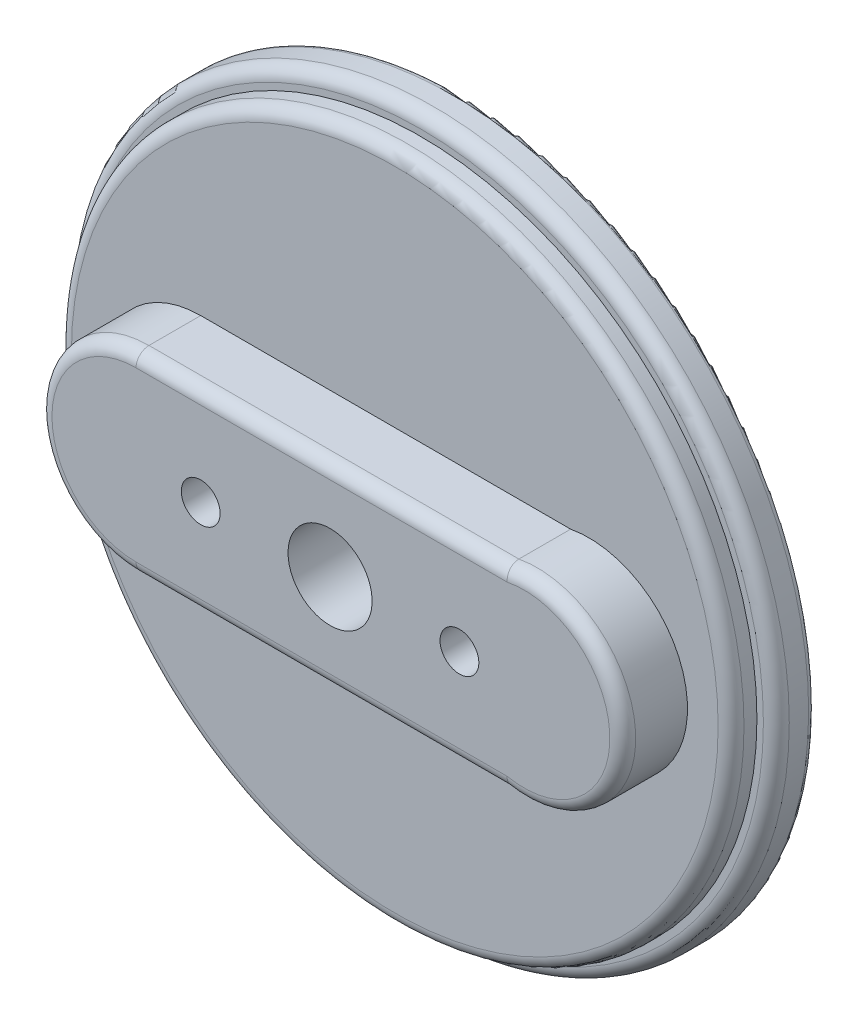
ISO-10303-21;
HEADER;
FILE_DESCRIPTION(('STEP AP214'),'2;1');
FILE_NAME('part.step','',(''),(''),'','','');
FILE_SCHEMA(('AUTOMOTIVE_DESIGN { 1 0 10303 214 1 1 1 1 }'));
ENDSEC;
DATA;
#1=APPLICATION_CONTEXT('core data for automotive mechanical design processes');
#2=APPLICATION_PROTOCOL_DEFINITION('international standard','automotive_design',2000,#1);
#3=PRODUCT_CONTEXT('',#1,'mechanical');
#4=PRODUCT('Part','Part','',(#3));
#5=PRODUCT_RELATED_PRODUCT_CATEGORY('part','',(#4));
#6=PRODUCT_DEFINITION_FORMATION('','',#4);
#7=PRODUCT_DEFINITION_CONTEXT('part definition',#1,'design');
#8=PRODUCT_DEFINITION('design','',#6,#7);
#9=PRODUCT_DEFINITION_SHAPE('','',#8);
#10=(LENGTH_UNIT() NAMED_UNIT(*) SI_UNIT(.MILLI.,.METRE.));
#11=(NAMED_UNIT(*) PLANE_ANGLE_UNIT() SI_UNIT($,.RADIAN.));
#12=(NAMED_UNIT(*) SI_UNIT($,.STERADIAN.) SOLID_ANGLE_UNIT());
#13=UNCERTAINTY_MEASURE_WITH_UNIT(LENGTH_MEASURE(1.E-05),#10,'distance_accuracy_value','');
#14=(GEOMETRIC_REPRESENTATION_CONTEXT(3) GLOBAL_UNCERTAINTY_ASSIGNED_CONTEXT((#13)) GLOBAL_UNIT_ASSIGNED_CONTEXT((#10,
#11,#12)) REPRESENTATION_CONTEXT('',''));
#15=CARTESIAN_POINT('',(0.,0.,0.));
#16=DIRECTION('',(0.,0.,1.));
#17=DIRECTION('',(1.,0.,0.));
#18=AXIS2_PLACEMENT_3D('',#15,#16,#17);
#19=CARTESIAN_POINT('',(0.,-60.6414213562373,5.));
#20=DIRECTION('',(0.,0.,1.));
#21=DIRECTION('',(1.,0.,0.));
#22=AXIS2_PLACEMENT_3D('',#19,#20,#21);
#23=PLANE('',#22);
#24=CARTESIAN_POINT('',(0.,0.,5.));
#25=DIRECTION('',(0.,0.,1.));
#26=DIRECTION('',(1.,0.,0.));
#27=AXIS2_PLACEMENT_3D('',#24,#25,#26);
#28=CIRCLE('',#27,25.);
#29=CARTESIAN_POINT('',(25.,0.,5.));
#30=VERTEX_POINT('',#29);
#31=EDGE_CURVE('E261',#30,#30,#28,.T.);
#32=ORIENTED_EDGE('',*,*,#31,.T.);
#33=EDGE_LOOP('',(#32));
#34=FACE_BOUND('',#33,.T.);
#35=CARTESIAN_POINT('',(15.,0.,5.));
#36=DIRECTION('',(0.,0.,1.));
#37=DIRECTION('',(1.,0.,0.));
#38=AXIS2_PLACEMENT_3D('',#35,#36,#37);
#39=CIRCLE('',#38,7.6299405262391);
#40=CARTESIAN_POINT('',(13.5978614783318,-7.5,5.));
#41=VERTEX_POINT('',#40);
#42=CARTESIAN_POINT('',(13.5978614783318,7.5,5.));
#43=VERTEX_POINT('',#42);
#44=EDGE_CURVE('E253',#41,#43,#39,.T.);
#45=ORIENTED_EDGE('',*,*,#44,.F.);
#46=DIRECTION('',(-1.,0.,0.));
#47=VECTOR('',#46,1.);
#48=CARTESIAN_POINT('',(0.,-7.5,5.));
#49=LINE('',#48,#47);
#50=CARTESIAN_POINT('',(-15.,-7.5,5.));
#51=VERTEX_POINT('',#50);
#52=EDGE_CURVE('E158',#41,#51,#49,.T.);
#53=ORIENTED_EDGE('',*,*,#52,.T.);
#54=CARTESIAN_POINT('',(-15.,0.,5.));
#55=DIRECTION('',(0.,0.,1.));
#56=DIRECTION('',(1.,0.,0.));
#57=AXIS2_PLACEMENT_3D('',#54,#55,#56);
#58=CIRCLE('',#57,7.5);
#59=CARTESIAN_POINT('',(-15.,7.5,5.));
#60=VERTEX_POINT('',#59);
#61=EDGE_CURVE('E251',#60,#51,#58,.T.);
#62=ORIENTED_EDGE('',*,*,#61,.F.);
#63=DIRECTION('',(-1.,0.,0.));
#64=VECTOR('',#63,1.);
#65=CARTESIAN_POINT('',(0.,7.5,5.));
#66=LINE('',#65,#64);
#67=EDGE_CURVE('E298',#43,#60,#66,.T.);
#68=ORIENTED_EDGE('',*,*,#67,.F.);
#69=EDGE_LOOP('',(#45,#53,#62,#68));
#70=FACE_BOUND('',#69,.T.);
#71=ADVANCED_FACE('F34',(#34,#70),#23,.T.);
#72=CARTESIAN_POINT('',(0.,0.,10.));
#73=DIRECTION('',(0.,0.,1.));
#74=DIRECTION('',(1.,0.,0.));
#75=AXIS2_PLACEMENT_3D('',#72,#73,#74);
#76=PLANE('',#75);
#77=CARTESIAN_POINT('',(10.,0.,10.));
#78=DIRECTION('',(0.,0.,1.));
#79=DIRECTION('',(1.,0.,0.));
#80=AXIS2_PLACEMENT_3D('',#77,#78,#79);
#81=CIRCLE('',#80,1.5);
#82=CARTESIAN_POINT('',(11.5,0.,10.));
#83=VERTEX_POINT('',#82);
#84=EDGE_CURVE('E417',#83,#83,#81,.T.);
#85=ORIENTED_EDGE('',*,*,#84,.F.);
#86=EDGE_LOOP('',(#85));
#87=FACE_BOUND('',#86,.T.);
#88=CARTESIAN_POINT('',(-10.,0.,10.));
#89=DIRECTION('',(0.,0.,1.));
#90=DIRECTION('',(1.,0.,0.));
#91=AXIS2_PLACEMENT_3D('',#88,#89,#90);
#92=CIRCLE('',#91,1.5);
#93=CARTESIAN_POINT('',(-8.5,0.,10.));
#94=VERTEX_POINT('',#93);
#95=EDGE_CURVE('E426',#94,#94,#92,.T.);
#96=ORIENTED_EDGE('',*,*,#95,.F.);
#97=EDGE_LOOP('',(#96));
#98=FACE_BOUND('',#97,.T.);
#99=DIRECTION('',(-1.,0.,0.));
#100=VECTOR('',#99,1.);
#101=CARTESIAN_POINT('',(13.5978614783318,-6.5,10.));
#102=LINE('',#101,#100);
#103=CARTESIAN_POINT('',(-15.,-6.5,10.));
#104=VERTEX_POINT('',#103);
#105=CARTESIAN_POINT('',(13.6938180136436,-6.5,10.));
#106=VERTEX_POINT('',#105);
#107=EDGE_CURVE('E272',#104,#106,#102,.F.);
#108=ORIENTED_EDGE('',*,*,#107,.T.);
#109=CARTESIAN_POINT('',(15.,0.,10.));
#110=DIRECTION('',(0.,0.,1.));
#111=DIRECTION('',(1.,0.,0.));
#112=AXIS2_PLACEMENT_3D('',#109,#110,#111);
#113=CIRCLE('',#112,6.6299405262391);
#114=CARTESIAN_POINT('',(13.6938180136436,6.5,10.));
#115=VERTEX_POINT('',#114);
#116=EDGE_CURVE('E274',#106,#115,#113,.T.);
#117=ORIENTED_EDGE('',*,*,#116,.T.);
#118=DIRECTION('',(-1.,0.,0.));
#119=VECTOR('',#118,1.);
#120=CARTESIAN_POINT('',(0.,6.5,10.));
#121=LINE('',#120,#119);
#122=CARTESIAN_POINT('',(-15.,6.5,10.));
#123=VERTEX_POINT('',#122);
#124=EDGE_CURVE('E268',#115,#123,#121,.T.);
#125=ORIENTED_EDGE('',*,*,#124,.T.);
#126=CARTESIAN_POINT('',(-15.,0.,10.));
#127=DIRECTION('',(0.,0.,1.));
#128=DIRECTION('',(1.,0.,0.));
#129=AXIS2_PLACEMENT_3D('',#126,#127,#128);
#130=CIRCLE('',#129,6.5);
#131=EDGE_CURVE('E270',#123,#104,#130,.T.);
#132=ORIENTED_EDGE('',*,*,#131,.T.);
#133=EDGE_LOOP('',(#108,#117,#125,#132));
#134=FACE_BOUND('',#133,.T.);
#135=CARTESIAN_POINT('',(0.,0.,10.));
#136=DIRECTION('',(0.,0.,-1.));
#137=DIRECTION('',(-1.,0.,0.));
#138=AXIS2_PLACEMENT_3D('',#135,#136,#137);
#139=CIRCLE('',#138,3.25);
#140=CARTESIAN_POINT('',(-3.25,0.,10.));
#141=VERTEX_POINT('',#140);
#142=EDGE_CURVE('E146',#141,#141,#139,.T.);
#143=ORIENTED_EDGE('',*,*,#142,.T.);
#144=EDGE_LOOP('',(#143));
#145=FACE_BOUND('',#144,.T.);
#146=ADVANCED_FACE('F204',(#87,#98,#134,#145),#76,.T.);
#147=CARTESIAN_POINT('',(0.,0.,3.));
#148=DIRECTION('',(0.,0.,-1.));
#149=DIRECTION('',(-1.,0.,0.));
#150=AXIS2_PLACEMENT_3D('',#147,#148,#149);
#151=PLANE('',#150);
#152=CARTESIAN_POINT('',(-15.,0.,3.));
#153=DIRECTION('',(0.,0.,-1.));
#154=DIRECTION('',(-1.,0.,0.));
#155=AXIS2_PLACEMENT_3D('',#152,#153,#154);
#156=CIRCLE('',#155,9.62787722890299);
#157=CARTESIAN_POINT('',(-13.4360243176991,9.5,3.));
#158=VERTEX_POINT('',#157);
#159=CARTESIAN_POINT('',(-13.0898573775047,-9.43649167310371,3.));
#160=VERTEX_POINT('',#159);
#161=EDGE_CURVE('E131',#158,#160,#156,.F.);
#162=ORIENTED_EDGE('',*,*,#161,.T.);
#163=DIRECTION('',(1.,0.,0.));
#164=VECTOR('',#163,1.);
#165=CARTESIAN_POINT('',(13.5332564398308,-9.43649167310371,3.));
#166=LINE('',#165,#164);
#167=CARTESIAN_POINT('',(-12.7919286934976,-9.43649167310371,3.));
#168=VERTEX_POINT('',#167);
#169=EDGE_CURVE('E123',#160,#168,#166,.T.);
#170=ORIENTED_EDGE('',*,*,#169,.T.);
#171=DIRECTION('',(1.,0.,0.));
#172=VECTOR('',#171,1.);
#173=CARTESIAN_POINT('',(13.5332564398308,-9.43649167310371,3.));
#174=LINE('',#173,#172);
#175=CARTESIAN_POINT('',(13.3563463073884,-9.43649167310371,3.));
#176=VERTEX_POINT('',#175);
#177=EDGE_CURVE('E128',#168,#176,#174,.T.);
#178=ORIENTED_EDGE('',*,*,#177,.T.);
#179=CARTESIAN_POINT('',(15.,0.,3.));
#180=DIRECTION('',(0.,0.,-1.));
#181=DIRECTION('',(-1.,0.,0.));
#182=AXIS2_PLACEMENT_3D('',#179,#180,#181);
#183=CIRCLE('',#182,9.57856839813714);
#184=CARTESIAN_POINT('',(13.7756746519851,-9.49999999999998,3.));
#185=VERTEX_POINT('',#184);
#186=EDGE_CURVE('E140',#176,#185,#183,.F.);
#187=ORIENTED_EDGE('',*,*,#186,.T.);
#188=CARTESIAN_POINT('',(15.,0.,3.));
#189=DIRECTION('',(0.,0.,-1.));
#190=DIRECTION('',(-1.,0.,0.));
#191=AXIS2_PLACEMENT_3D('',#188,#189,#190);
#192=CIRCLE('',#191,9.57856839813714);
#193=CARTESIAN_POINT('',(13.7756746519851,9.49999999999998,3.));
#194=VERTEX_POINT('',#193);
#195=EDGE_CURVE('E142',#185,#194,#192,.F.);
#196=ORIENTED_EDGE('',*,*,#195,.T.);
#197=CARTESIAN_POINT('',(15.,0.,3.));
#198=DIRECTION('',(0.,0.,-1.));
#199=DIRECTION('',(-1.,0.,0.));
#200=AXIS2_PLACEMENT_3D('',#197,#198,#199);
#201=CIRCLE('',#200,9.57856839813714);
#202=CARTESIAN_POINT('',(13.3563463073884,9.43649167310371,3.));
#203=VERTEX_POINT('',#202);
#204=EDGE_CURVE('E149',#194,#203,#201,.F.);
#205=ORIENTED_EDGE('',*,*,#204,.T.);
#206=DIRECTION('',(-1.,0.,0.));
#207=VECTOR('',#206,1.);
#208=CARTESIAN_POINT('',(-13.2948865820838,9.43649167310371,3.));
#209=LINE('',#208,#207);
#210=CARTESIAN_POINT('',(-13.0898573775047,9.43649167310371,3.));
#211=VERTEX_POINT('',#210);
#212=EDGE_CURVE('E151',#203,#211,#209,.T.);
#213=ORIENTED_EDGE('',*,*,#212,.T.);
#214=CARTESIAN_POINT('',(-15.,0.,3.));
#215=DIRECTION('',(0.,0.,-1.));
#216=DIRECTION('',(-1.,0.,0.));
#217=AXIS2_PLACEMENT_3D('',#214,#215,#216);
#218=CIRCLE('',#217,9.62787722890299);
#219=EDGE_CURVE('E152',#211,#158,#218,.F.);
#220=ORIENTED_EDGE('',*,*,#219,.T.);
#221=EDGE_LOOP('',(#162,#170,#178,#187,#196,#205,#213,#220));
#222=FACE_BOUND('',#221,.T.);
#223=CARTESIAN_POINT('',(0.,0.,3.));
#224=DIRECTION('',(0.,0.,1.));
#225=DIRECTION('',(1.,0.,0.));
#226=AXIS2_PLACEMENT_3D('',#223,#224,#225);
#227=CIRCLE('',#226,26.);
#228=CARTESIAN_POINT('',(26.,0.,3.));
#229=VERTEX_POINT('',#228);
#230=EDGE_CURVE('E258',#229,#229,#227,.T.);
#231=ORIENTED_EDGE('',*,*,#230,.F.);
#232=EDGE_LOOP('',(#231));
#233=FACE_BOUND('',#232,.T.);
#234=ADVANCED_FACE('F125',(#222,#233),#151,.T.);
#235=CARTESIAN_POINT('',(0.,0.,10.));
#236=DIRECTION('',(0.,0.,-1.));
#237=DIRECTION('',(-1.,0.,0.));
#238=AXIS2_PLACEMENT_3D('',#235,#236,#237);
#239=CYLINDRICAL_SURFACE('',#238,3.25);
#240=ORIENTED_EDGE('',*,*,#142,.F.);
#241=EDGE_LOOP('',(#240));
#242=FACE_BOUND('',#241,.T.);
#243=CARTESIAN_POINT('',(0.,0.,4.5));
#244=DIRECTION('',(0.,0.,-1.));
#245=DIRECTION('',(-1.,0.,0.));
#246=AXIS2_PLACEMENT_3D('',#243,#244,#245);
#247=CIRCLE('',#246,3.25);
#248=CARTESIAN_POINT('',(-3.25,0.,4.5));
#249=VERTEX_POINT('',#248);
#250=EDGE_CURVE('E154',#249,#249,#247,.T.);
#251=ORIENTED_EDGE('',*,*,#250,.T.);
#252=EDGE_LOOP('',(#251));
#253=FACE_BOUND('',#252,.T.);
#254=ADVANCED_FACE('F197',(#242,#253),#239,.F.);
#255=CARTESIAN_POINT('',(-57.3414213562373,0.,4.5));
#256=DIRECTION('',(0.,0.,-1.));
#257=DIRECTION('',(-1.,0.,0.));
#258=AXIS2_PLACEMENT_3D('',#255,#256,#257);
#259=PLANE('',#258);
#260=CARTESIAN_POINT('',(10.,0.,4.5));
#261=DIRECTION('',(0.,0.,-1.));
#262=DIRECTION('',(-1.,0.,0.));
#263=AXIS2_PLACEMENT_3D('',#260,#261,#262);
#264=CIRCLE('',#263,1.5);
#265=CARTESIAN_POINT('',(8.5,0.,4.5));
#266=VERTEX_POINT('',#265);
#267=EDGE_CURVE('E420',#266,#266,#264,.T.);
#268=ORIENTED_EDGE('',*,*,#267,.F.);
#269=EDGE_LOOP('',(#268));
#270=FACE_BOUND('',#269,.T.);
#271=CARTESIAN_POINT('',(-10.,0.,4.5));
#272=DIRECTION('',(0.,0.,-1.));
#273=DIRECTION('',(-1.,0.,0.));
#274=AXIS2_PLACEMENT_3D('',#271,#272,#273);
#275=CIRCLE('',#274,1.5);
#276=CARTESIAN_POINT('',(-11.5,0.,4.5));
#277=VERTEX_POINT('',#276);
#278=EDGE_CURVE('E422',#277,#277,#275,.T.);
#279=ORIENTED_EDGE('',*,*,#278,.F.);
#280=EDGE_LOOP('',(#279));
#281=FACE_BOUND('',#280,.T.);
#282=DIRECTION('',(1.,0.,0.));
#283=VECTOR('',#282,1.);
#284=CARTESIAN_POINT('',(-57.3414213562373,-7.5,4.5));
#285=LINE('',#284,#283);
#286=CARTESIAN_POINT('',(-13.2948865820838,-7.5,4.5));
#287=VERTEX_POINT('',#286);
#288=CARTESIAN_POINT('',(13.5332564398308,-7.5,4.5));
#289=VERTEX_POINT('',#288);
#290=EDGE_CURVE('E171',#287,#289,#285,.T.);
#291=ORIENTED_EDGE('',*,*,#290,.F.);
#292=CARTESIAN_POINT('',(-15.,0.,4.5));
#293=DIRECTION('',(0.,0.,-1.));
#294=DIRECTION('',(-1.,0.,0.));
#295=AXIS2_PLACEMENT_3D('',#292,#293,#294);
#296=CIRCLE('',#295,7.69138555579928);
#297=CARTESIAN_POINT('',(-13.2948865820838,7.5,4.5));
#298=VERTEX_POINT('',#297);
#299=EDGE_CURVE('E161',#287,#298,#296,.T.);
#300=ORIENTED_EDGE('',*,*,#299,.T.);
#301=DIRECTION('',(-1.,0.,0.));
#302=VECTOR('',#301,1.);
#303=CARTESIAN_POINT('',(-57.3414213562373,7.5,4.5));
#304=LINE('',#303,#302);
#305=CARTESIAN_POINT('',(13.5332564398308,7.5,4.5));
#306=VERTEX_POINT('',#305);
#307=EDGE_CURVE('E166',#306,#298,#304,.T.);
#308=ORIENTED_EDGE('',*,*,#307,.F.);
#309=CARTESIAN_POINT('',(15.,0.,4.5));
#310=DIRECTION('',(0.,0.,-1.));
#311=DIRECTION('',(-1.,0.,0.));
#312=AXIS2_PLACEMENT_3D('',#309,#310,#311);
#313=CIRCLE('',#312,7.64207672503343);
#314=EDGE_CURVE('E162',#306,#289,#313,.T.);
#315=ORIENTED_EDGE('',*,*,#314,.T.);
#316=EDGE_LOOP('',(#291,#300,#308,#315));
#317=FACE_BOUND('',#316,.T.);
#318=ORIENTED_EDGE('',*,*,#250,.F.);
#319=EDGE_LOOP('',(#318));
#320=FACE_BOUND('',#319,.T.);
#321=ADVANCED_FACE('F192',(#270,#281,#317,#320),#259,.T.);
#322=CARTESIAN_POINT('',(-15.,0.,5.));
#323=DIRECTION('',(0.,0.,-1.));
#324=DIRECTION('',(-1.,0.,0.));
#325=AXIS2_PLACEMENT_3D('',#322,#323,#324);
#326=TOROIDAL_SURFACE('',#325,9.62787722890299,2.);
#327=ORIENTED_EDGE('',*,*,#161,.F.);
#328=ORIENTED_EDGE('',*,*,#219,.F.);
#329=CARTESIAN_POINT('',(-13.1850756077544,8.5098431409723,6.77237763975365));
#330=CARTESIAN_POINT('',(-13.1903313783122,8.46000103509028,6.74631820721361));
#331=CARTESIAN_POINT('',(-13.1954926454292,8.41127426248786,6.7181641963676));
#332=CARTESIAN_POINT('',(-13.2055887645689,8.31634820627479,6.65784331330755));
#333=CARTESIAN_POINT('',(-13.2105236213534,8.27014886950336,6.62567652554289));
#334=CARTESIAN_POINT('',(-13.22491962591,8.13590692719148,6.52351308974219));
#335=CARTESIAN_POINT('',(-13.2339868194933,8.05208214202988,6.44778095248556));
#336=CARTESIAN_POINT('',(-13.2507330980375,7.89828605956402,6.28321167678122));
#337=CARTESIAN_POINT('',(-13.2584113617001,7.82832295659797,6.19436684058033));
#338=CARTESIAN_POINT('',(-13.2720937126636,7.70430339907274,6.00609110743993));
#339=CARTESIAN_POINT('',(-13.278098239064,7.65024277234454,5.90666299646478));
#340=CARTESIAN_POINT('',(-13.2881802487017,7.55979966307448,5.70046614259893));
#341=CARTESIAN_POINT('',(-13.292265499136,7.52334590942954,5.59372902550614));
#342=CARTESIAN_POINT('',(-13.2983826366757,7.46885969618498,5.37558213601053));
#343=CARTESIAN_POINT('',(-13.3004143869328,7.45082846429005,5.26417205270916));
#344=CARTESIAN_POINT('',(-13.3023165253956,7.4339462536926,5.04274809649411));
#345=CARTESIAN_POINT('',(-13.3022405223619,7.4346195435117,4.93277068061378));
#346=CARTESIAN_POINT('',(-13.3000626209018,7.45395206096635,4.7144360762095));
#347=CARTESIAN_POINT('',(-13.2979608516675,7.47261014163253,4.60607878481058));
#348=CARTESIAN_POINT('',(-13.2917362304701,7.52806770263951,4.39129597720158));
#349=CARTESIAN_POINT('',(-13.2875646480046,7.56530471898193,4.28498463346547));
#350=CARTESIAN_POINT('',(-13.2773445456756,7.65702367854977,4.08017028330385));
#351=CARTESIAN_POINT('',(-13.2712958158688,7.7115075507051,3.98166815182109));
#352=CARTESIAN_POINT('',(-13.2575551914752,7.8361150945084,3.79527624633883));
#353=CARTESIAN_POINT('',(-13.2498636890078,7.90623503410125,3.70738394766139));
#354=CARTESIAN_POINT('',(-13.2331178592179,8.06010189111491,3.54463377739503));
#355=CARTESIAN_POINT('',(-13.2240635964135,8.14384816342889,3.46977528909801));
#356=CARTESIAN_POINT('',(-13.2048664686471,8.32294670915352,3.33487539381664));
#357=CARTESIAN_POINT('',(-13.1947193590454,8.41834444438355,3.27489498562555));
#358=CARTESIAN_POINT('',(-13.1736944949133,8.61782131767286,3.17178246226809));
#359=CARTESIAN_POINT('',(-13.1628165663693,8.72190252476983,3.12865437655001));
#360=CARTESIAN_POINT('',(-13.1419093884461,8.92380621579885,3.06425369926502));
#361=CARTESIAN_POINT('',(-13.1319204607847,9.02103567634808,3.04108263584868));
#362=CARTESIAN_POINT('',(-13.1118793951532,9.21770462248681,3.00952046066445));
#363=CARTESIAN_POINT('',(-13.1018274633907,9.31713831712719,3.00109441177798));
#364=CARTESIAN_POINT('',(-13.0911923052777,9.42317175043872,3.00003314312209));
#365=CARTESIAN_POINT('',(-13.0905246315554,9.42983204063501,2.99999986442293));
#366=CARTESIAN_POINT('',(-13.0898573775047,9.43649167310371,3.));
#367=B_SPLINE_CURVE_WITH_KNOTS('',3,(#329,#330,#331,#332,#333,#334,#335,#336,#337,#338,#339,
#340,#341,#342,#343,#344,#345,#346,#347,#348,#349,#350,#351,#352,#353,#354,#355,#356,#357,#358,
#359,#360,#361,#362,#363,#364,#365,#366),.UNSPECIFIED.,.F.,.F.,(4,2,2,2,2,2,2,2,2,2,2,2,2,2,2,2,
2,2,4),(0.,0.169362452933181,0.338721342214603,0.676974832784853,1.01542768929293,
1.353791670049,1.69077425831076,2.02777930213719,2.3562209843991,2.6846417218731,
3.02119021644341,3.35777636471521,3.69428226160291,4.03077223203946,4.3686197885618,
4.70654807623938,5.00685907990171,5.30645755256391,5.32653843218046),.UNSPECIFIED.);
#368=EDGE_CURVE('E165',#298,#211,#367,.T.);
#369=ORIENTED_EDGE('',*,*,#368,.F.);
#370=ORIENTED_EDGE('',*,*,#299,.F.);
#371=CARTESIAN_POINT('',(-13.1850756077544,-8.5098431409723,6.77237763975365));
#372=CARTESIAN_POINT('',(-13.1903313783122,-8.46000103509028,6.74631820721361));
#373=CARTESIAN_POINT('',(-13.1954926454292,-8.41127426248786,6.7181641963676));
#374=CARTESIAN_POINT('',(-13.2055887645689,-8.31634820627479,6.65784331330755));
#375=CARTESIAN_POINT('',(-13.2105236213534,-8.27014886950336,6.62567652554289));
#376=CARTESIAN_POINT('',(-13.22491962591,-8.13590692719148,6.52351308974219));
#377=CARTESIAN_POINT('',(-13.2339868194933,-8.05208214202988,6.44778095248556));
#378=CARTESIAN_POINT('',(-13.2507330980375,-7.89828605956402,6.28321167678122));
#379=CARTESIAN_POINT('',(-13.2584113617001,-7.82832295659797,6.19436684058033));
#380=CARTESIAN_POINT('',(-13.2720937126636,-7.70430339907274,6.00609110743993));
#381=CARTESIAN_POINT('',(-13.278098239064,-7.65024277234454,5.90666299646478));
#382=CARTESIAN_POINT('',(-13.2881802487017,-7.55979966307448,5.70046614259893));
#383=CARTESIAN_POINT('',(-13.292265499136,-7.52334590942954,5.59372902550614));
#384=CARTESIAN_POINT('',(-13.2983826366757,-7.46885969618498,5.37558213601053));
#385=CARTESIAN_POINT('',(-13.3004143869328,-7.45082846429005,5.26417205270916));
#386=CARTESIAN_POINT('',(-13.3023165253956,-7.4339462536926,5.04274809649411));
#387=CARTESIAN_POINT('',(-13.3022405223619,-7.4346195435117,4.93277068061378));
#388=CARTESIAN_POINT('',(-13.3000626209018,-7.45395206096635,4.7144360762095));
#389=CARTESIAN_POINT('',(-13.2979608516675,-7.47261014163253,4.60607878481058));
#390=CARTESIAN_POINT('',(-13.2917362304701,-7.52806770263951,4.39129597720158));
#391=CARTESIAN_POINT('',(-13.2875646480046,-7.56530471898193,4.28498463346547));
#392=CARTESIAN_POINT('',(-13.2773445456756,-7.65702367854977,4.08017028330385));
#393=CARTESIAN_POINT('',(-13.2712958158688,-7.7115075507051,3.98166815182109));
#394=CARTESIAN_POINT('',(-13.2575551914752,-7.8361150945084,3.79527624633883));
#395=CARTESIAN_POINT('',(-13.2498636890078,-7.90623503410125,3.70738394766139));
#396=CARTESIAN_POINT('',(-13.2331178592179,-8.06010189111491,3.54463377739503));
#397=CARTESIAN_POINT('',(-13.2240635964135,-8.14384816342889,3.46977528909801));
#398=CARTESIAN_POINT('',(-13.2048664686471,-8.32294670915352,3.33487539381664));
#399=CARTESIAN_POINT('',(-13.1947193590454,-8.41834444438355,3.27489498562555));
#400=CARTESIAN_POINT('',(-13.1736944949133,-8.61782131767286,3.17178246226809));
#401=CARTESIAN_POINT('',(-13.1628165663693,-8.72190252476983,3.12865437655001));
#402=CARTESIAN_POINT('',(-13.1419093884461,-8.92380621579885,3.06425369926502));
#403=CARTESIAN_POINT('',(-13.1319204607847,-9.02103567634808,3.04108263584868));
#404=CARTESIAN_POINT('',(-13.1118793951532,-9.21770462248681,3.00952046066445));
#405=CARTESIAN_POINT('',(-13.1018274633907,-9.31713831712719,3.00109441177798));
#406=CARTESIAN_POINT('',(-13.0911923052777,-9.42317175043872,3.00003314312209));
#407=CARTESIAN_POINT('',(-13.0905246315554,-9.42983204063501,2.99999986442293));
#408=CARTESIAN_POINT('',(-13.0898573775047,-9.43649167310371,3.));
#409=B_SPLINE_CURVE_WITH_KNOTS('',3,(#371,#372,#373,#374,#375,#376,#377,#378,#379,#380,#381,
#382,#383,#384,#385,#386,#387,#388,#389,#390,#391,#392,#393,#394,#395,#396,#397,#398,#399,#400,
#401,#402,#403,#404,#405,#406,#407,#408),.UNSPECIFIED.,.F.,.F.,(4,2,2,2,2,2,2,2,2,2,2,2,2,2,2,2,
2,2,4),(0.,0.169362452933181,0.338721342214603,0.676974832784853,1.01542768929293,
1.353791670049,1.69077425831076,2.02777930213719,2.3562209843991,2.6846417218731,
3.02119021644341,3.35777636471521,3.69428226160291,4.03077223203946,4.3686197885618,
4.70654807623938,5.00685907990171,5.30645755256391,5.32653843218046),.UNSPECIFIED.);
#410=EDGE_CURVE('E169',#160,#287,#409,.F.);
#411=ORIENTED_EDGE('',*,*,#410,.F.);
#412=EDGE_LOOP('',(#327,#328,#369,#370,#411));
#413=FACE_BOUND('',#412,.T.);
#414=ADVANCED_FACE('F188',(#413),#326,.T.);
#415=CARTESIAN_POINT('',(-57.3414213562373,9.43649167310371,5.));
#416=DIRECTION('',(1.,0.,0.));
#417=DIRECTION('',(0.,0.,-1.));
#418=AXIS2_PLACEMENT_3D('',#415,#416,#417);
#419=CYLINDRICAL_SURFACE('',#418,2.);
#420=ORIENTED_EDGE('',*,*,#368,.T.);
#421=ORIENTED_EDGE('',*,*,#212,.F.);
#422=CARTESIAN_POINT('',(13.3563463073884,9.43649167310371,3.));
#423=CARTESIAN_POINT('',(13.3569660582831,9.42932186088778,2.99999980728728));
#424=CARTESIAN_POINT('',(13.3575862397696,9.42215118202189,3.0000383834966));
#425=CARTESIAN_POINT('',(13.3679458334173,9.30243982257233,3.00132891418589));
#426=CARTESIAN_POINT('',(13.3777806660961,9.18980399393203,3.01208109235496));
#427=CARTESIAN_POINT('',(13.3973472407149,8.96773875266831,3.05242084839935));
#428=CARTESIAN_POINT('',(13.4070786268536,8.85831895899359,3.08205989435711));
#429=CARTESIAN_POINT('',(13.4261214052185,8.64609432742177,3.15934781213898));
#430=CARTESIAN_POINT('',(13.4354332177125,8.54328282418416,3.20697819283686));
#431=CARTESIAN_POINT('',(13.4533439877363,8.34717564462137,3.31888952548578));
#432=CARTESIAN_POINT('',(13.4619433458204,8.2538746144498,3.38316103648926));
#433=CARTESIAN_POINT('',(13.4781389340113,8.07947145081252,3.52649230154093));
#434=CARTESIAN_POINT('',(13.4857360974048,7.99835795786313,3.60553812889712));
#435=CARTESIAN_POINT('',(13.4996649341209,7.8505852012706,3.77622182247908));
#436=CARTESIAN_POINT('',(13.5059970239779,7.78392117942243,3.86785552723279));
#437=CARTESIAN_POINT('',(13.5163799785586,7.67514671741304,4.04757571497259));
#438=CARTESIAN_POINT('',(13.5206258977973,7.63090779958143,4.13437177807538));
#439=CARTESIAN_POINT('',(13.5278868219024,7.55548881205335,4.31350765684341));
#440=CARTESIAN_POINT('',(13.5309018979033,7.52430798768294,4.40584715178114));
#441=CARTESIAN_POINT('',(13.5359657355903,7.47202957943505,4.60833865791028));
#442=CARTESIAN_POINT('',(13.5378004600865,7.45315904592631,4.71907826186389));
#443=CARTESIAN_POINT('',(13.539644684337,7.43419090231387,4.94220884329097));
#444=CARTESIAN_POINT('',(13.5396533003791,7.43410238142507,5.05460059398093));
#445=CARTESIAN_POINT('',(13.5378435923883,7.45271533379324,5.27779008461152));
#446=CARTESIAN_POINT('',(13.5360255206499,7.4714142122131,5.38858804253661));
#447=CARTESIAN_POINT('',(13.5306364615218,7.52704655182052,5.60543145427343));
#448=CARTESIAN_POINT('',(13.5270658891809,7.56397569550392,5.71147802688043));
#449=CARTESIAN_POINT('',(13.5183092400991,7.65502822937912,5.91592308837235));
#450=CARTESIAN_POINT('',(13.5131221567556,7.70916233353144,6.01431676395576));
#451=CARTESIAN_POINT('',(13.5013302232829,7.83305861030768,6.20063737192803));
#452=CARTESIAN_POINT('',(13.4947249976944,7.90282492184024,6.28856152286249));
#453=CARTESIAN_POINT('',(13.4803092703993,8.05628888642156,6.4517604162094));
#454=CARTESIAN_POINT('',(13.472495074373,8.14002930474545,6.5269948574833));
#455=CARTESIAN_POINT('',(13.460094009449,8.27407671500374,6.6284809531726));
#456=CARTESIAN_POINT('',(13.4558437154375,8.3202016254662,6.66043432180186));
#457=CARTESIAN_POINT('',(13.4471496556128,8.41495832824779,6.72035125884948));
#458=CARTESIAN_POINT('',(13.4427058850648,8.46359018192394,6.74831472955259));
#459=CARTESIAN_POINT('',(13.4381813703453,8.51332839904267,6.77419547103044));
#460=B_SPLINE_CURVE_WITH_KNOTS('',3,(#422,#423,#424,#425,#426,#427,#428,#429,#430,#431,#432,
#433,#434,#435,#436,#437,#438,#439,#440,#441,#442,#443,#444,#445,#446,#447,#448,#449,#450,#451,
#452,#453,#454,#455,#456,#457,#458,#459),.UNSPECIFIED.,.F.,.F.,(4,2,2,2,2,2,2,2,2,2,2,2,2,2,2,2,
2,2,4),(0.,0.0215921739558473,0.360452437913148,0.70024009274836,1.039679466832,
1.37892668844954,1.71785572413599,2.05667298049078,2.34819381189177,2.63969779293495,
2.97512205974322,3.31070864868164,3.64624889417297,3.98170971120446,4.31737983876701,
4.65313894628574,4.98994509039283,5.15859155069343,5.32724214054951),.UNSPECIFIED.);
#461=EDGE_CURVE('E257',#306,#203,#460,.F.);
#462=ORIENTED_EDGE('',*,*,#461,.F.);
#463=ORIENTED_EDGE('',*,*,#307,.T.);
#464=EDGE_LOOP('',(#420,#421,#462,#463));
#465=FACE_BOUND('',#464,.T.);
#466=ADVANCED_FACE('F185',(#465),#419,.T.);
#467=CARTESIAN_POINT('',(-57.3414213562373,-9.43649167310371,5.));
#468=DIRECTION('',(-1.,0.,0.));
#469=DIRECTION('',(0.,0.,1.));
#470=AXIS2_PLACEMENT_3D('',#467,#468,#469);
#471=CYLINDRICAL_SURFACE('',#470,2.);
#472=ORIENTED_EDGE('',*,*,#410,.T.);
#473=ORIENTED_EDGE('',*,*,#290,.T.);
#474=CARTESIAN_POINT('',(13.4381813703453,-8.51332839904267,6.77419547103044));
#475=CARTESIAN_POINT('',(13.4427205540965,-8.46342891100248,6.74823083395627));
#476=CARTESIAN_POINT('',(13.4471784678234,-8.41464300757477,6.72016991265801));
#477=CARTESIAN_POINT('',(13.4558994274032,-8.31959572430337,6.66003296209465));
#478=CARTESIAN_POINT('',(13.4601624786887,-8.27333427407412,6.62795704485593));
#479=CARTESIAN_POINT('',(13.4725993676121,-8.13890667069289,6.52606775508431));
#480=CARTESIAN_POINT('',(13.4804340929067,-8.05495301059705,6.45051763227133));
#481=CARTESIAN_POINT('',(13.4949079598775,-7.90088442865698,6.28631626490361));
#482=CARTESIAN_POINT('',(13.5015464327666,-7.83077724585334,6.19765774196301));
#483=CARTESIAN_POINT('',(13.5133820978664,-7.70644127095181,6.00975545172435));
#484=CARTESIAN_POINT('',(13.5185796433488,-7.65220858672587,5.91051428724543));
#485=CARTESIAN_POINT('',(13.5273204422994,-7.56133733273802,5.70457636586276));
#486=CARTESIAN_POINT('',(13.5308686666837,-7.52464588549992,5.59790314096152));
#487=CARTESIAN_POINT('',(13.5361939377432,-7.4696795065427,5.37985576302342));
#488=CARTESIAN_POINT('',(13.5379708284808,-7.45140619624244,5.26848119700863));
#489=CARTESIAN_POINT('',(13.539664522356,-7.43398751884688,5.04637344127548));
#490=CARTESIAN_POINT('',(13.53961608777,-7.43448467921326,4.93566839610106));
#491=CARTESIAN_POINT('',(13.5377473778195,-7.45370535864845,4.71587459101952));
#492=CARTESIAN_POINT('',(13.53592721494,-7.47242772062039,4.60678572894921));
#493=CARTESIAN_POINT('',(13.530536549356,-7.52807933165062,4.39125048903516));
#494=CARTESIAN_POINT('',(13.5269344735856,-7.56533707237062,4.28488959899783));
#495=CARTESIAN_POINT('',(13.5181081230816,-7.65712471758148,4.07996748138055));
#496=CARTESIAN_POINT('',(13.5128837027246,-7.71165617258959,3.98140695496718));
#497=CARTESIAN_POINT('',(13.5010134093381,-7.83639941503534,3.79488996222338));
#498=CARTESIAN_POINT('',(13.4943677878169,-7.90660842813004,3.70693162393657));
#499=CARTESIAN_POINT('',(13.4798971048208,-8.06069683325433,3.54406221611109));
#500=CARTESIAN_POINT('',(13.4720720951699,-8.14457562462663,3.46915057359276));
#501=CARTESIAN_POINT('',(13.4554885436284,-8.32388612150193,3.33424560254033));
#502=CARTESIAN_POINT('',(13.4467272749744,-8.41935168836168,3.27429764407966));
#503=CARTESIAN_POINT('',(13.4285739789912,-8.61897578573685,3.17126318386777));
#504=CARTESIAN_POINT('',(13.4191818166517,-8.72313617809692,3.12818030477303));
#505=CARTESIAN_POINT('',(13.4011772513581,-8.92467365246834,3.06404928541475));
#506=CARTESIAN_POINT('',(13.3926009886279,-9.02143339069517,3.04102302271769));
#507=CARTESIAN_POINT('',(13.3753945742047,-9.21714420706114,3.00960620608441));
#508=CARTESIAN_POINT('',(13.3667645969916,-9.31608958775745,3.00118131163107));
#509=CARTESIAN_POINT('',(13.3575862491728,-9.42215108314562,3.00003841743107));
#510=CARTESIAN_POINT('',(13.35696606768,-9.42932176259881,2.99999984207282));
#511=CARTESIAN_POINT('',(13.3563463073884,-9.43649167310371,3.));
#512=B_SPLINE_CURVE_WITH_KNOTS('',3,(#474,#475,#476,#477,#478,#479,#480,#481,#482,#483,#484,
#485,#486,#487,#488,#489,#490,#491,#492,#493,#494,#495,#496,#497,#498,#499,#500,#501,#502,#503,
#504,#505,#506,#507,#508,#509,#510,#511),.UNSPECIFIED.,.F.,.F.,(4,2,2,2,2,2,2,2,2,2,2,2,2,2,2,2,
2,2,4),(0.,0.169196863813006,0.338389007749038,0.676289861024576,1.01437904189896,
1.35238526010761,1.68936604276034,2.02637648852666,2.35697206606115,2.68754665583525,
3.02420048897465,3.36088454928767,3.69750907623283,4.03411881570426,4.37173709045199,
4.70942784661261,5.00789551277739,5.30566026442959,5.32725243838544),.UNSPECIFIED.);
#513=EDGE_CURVE('E139',#176,#289,#512,.F.);
#514=ORIENTED_EDGE('',*,*,#513,.F.);
#515=ORIENTED_EDGE('',*,*,#177,.F.);
#516=ORIENTED_EDGE('',*,*,#169,.F.);
#517=EDGE_LOOP('',(#472,#473,#514,#515,#516));
#518=FACE_BOUND('',#517,.T.);
#519=ADVANCED_FACE('F137',(#518),#471,.T.);
#520=CARTESIAN_POINT('',(15.,0.,5.));
#521=DIRECTION('',(0.,0.,-1.));
#522=DIRECTION('',(-1.,0.,0.));
#523=AXIS2_PLACEMENT_3D('',#520,#521,#522);
#524=TOROIDAL_SURFACE('',#523,9.57856839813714,2.);
#525=ORIENTED_EDGE('',*,*,#195,.F.);
#526=ORIENTED_EDGE('',*,*,#186,.F.);
#527=ORIENTED_EDGE('',*,*,#513,.T.);
#528=ORIENTED_EDGE('',*,*,#314,.F.);
#529=ORIENTED_EDGE('',*,*,#461,.T.);
#530=ORIENTED_EDGE('',*,*,#204,.F.);
#531=EDGE_LOOP('',(#525,#526,#527,#528,#529,#530));
#532=FACE_BOUND('',#531,.T.);
#533=ADVANCED_FACE('F317',(#532),#524,.T.);
#534=CARTESIAN_POINT('',(15.,0.,5.));
#535=DIRECTION('',(0.,0.,1.));
#536=DIRECTION('',(1.,0.,0.));
#537=AXIS2_PLACEMENT_3D('',#534,#535,#536);
#538=CYLINDRICAL_SURFACE('',#537,7.6299405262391);
#539=DIRECTION('',(0.,0.,1.));
#540=VECTOR('',#539,1.);
#541=CARTESIAN_POINT('',(13.5978614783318,7.5,5.));
#542=LINE('',#541,#540);
#543=CARTESIAN_POINT('',(13.5978614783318,7.5,9.));
#544=VERTEX_POINT('',#543);
#545=EDGE_CURVE('E256',#43,#544,#542,.T.);
#546=ORIENTED_EDGE('',*,*,#545,.T.);
#547=CARTESIAN_POINT('',(15.,0.,9.));
#548=DIRECTION('',(0.,0.,1.));
#549=DIRECTION('',(1.,0.,0.));
#550=AXIS2_PLACEMENT_3D('',#547,#548,#549);
#551=CIRCLE('',#550,7.6299405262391);
#552=CARTESIAN_POINT('',(13.5978614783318,-7.5,9.));
#553=VERTEX_POINT('',#552);
#554=EDGE_CURVE('E277',#544,#553,#551,.F.);
#555=ORIENTED_EDGE('',*,*,#554,.T.);
#556=DIRECTION('',(0.,0.,1.));
#557=VECTOR('',#556,1.);
#558=CARTESIAN_POINT('',(13.5978614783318,-7.5,5.));
#559=LINE('',#558,#557);
#560=EDGE_CURVE('E262',#41,#553,#559,.T.);
#561=ORIENTED_EDGE('',*,*,#560,.F.);
#562=ORIENTED_EDGE('',*,*,#44,.T.);
#563=EDGE_LOOP('',(#546,#555,#561,#562));
#564=FACE_BOUND('',#563,.T.);
#565=ADVANCED_FACE('F283',(#564),#538,.T.);
#566=CARTESIAN_POINT('',(0.,7.5,5.));
#567=DIRECTION('',(0.,1.,0.));
#568=DIRECTION('',(-1.,0.,0.));
#569=AXIS2_PLACEMENT_3D('',#566,#567,#568);
#570=PLANE('',#569);
#571=DIRECTION('',(0.,0.,1.));
#572=VECTOR('',#571,1.);
#573=CARTESIAN_POINT('',(-15.,7.5,5.));
#574=LINE('',#573,#572);
#575=CARTESIAN_POINT('',(-15.,7.5,9.));
#576=VERTEX_POINT('',#575);
#577=EDGE_CURVE('E296',#60,#576,#574,.T.);
#578=ORIENTED_EDGE('',*,*,#577,.T.);
#579=DIRECTION('',(-1.,0.,0.));
#580=VECTOR('',#579,1.);
#581=CARTESIAN_POINT('',(0.,7.5,9.));
#582=LINE('',#581,#580);
#583=EDGE_CURVE('E12',#576,#544,#582,.F.);
#584=ORIENTED_EDGE('',*,*,#583,.T.);
#585=ORIENTED_EDGE('',*,*,#545,.F.);
#586=ORIENTED_EDGE('',*,*,#67,.T.);
#587=EDGE_LOOP('',(#578,#584,#585,#586));
#588=FACE_BOUND('',#587,.T.);
#589=ADVANCED_FACE('F300',(#588),#570,.T.);
#590=CARTESIAN_POINT('',(-15.,0.,5.));
#591=DIRECTION('',(0.,0.,1.));
#592=DIRECTION('',(1.,0.,0.));
#593=AXIS2_PLACEMENT_3D('',#590,#591,#592);
#594=CYLINDRICAL_SURFACE('',#593,7.5);
#595=DIRECTION('',(0.,0.,1.));
#596=VECTOR('',#595,1.);
#597=CARTESIAN_POINT('',(-15.,-7.5,5.));
#598=LINE('',#597,#596);
#599=CARTESIAN_POINT('',(-15.,-7.5,9.));
#600=VERTEX_POINT('',#599);
#601=EDGE_CURVE('E288',#51,#600,#598,.T.);
#602=ORIENTED_EDGE('',*,*,#601,.T.);
#603=CARTESIAN_POINT('',(-15.,0.,9.));
#604=DIRECTION('',(0.,0.,1.));
#605=DIRECTION('',(1.,0.,0.));
#606=AXIS2_PLACEMENT_3D('',#603,#604,#605);
#607=CIRCLE('',#606,7.5);
#608=EDGE_CURVE('E42',#600,#576,#607,.F.);
#609=ORIENTED_EDGE('',*,*,#608,.T.);
#610=ORIENTED_EDGE('',*,*,#577,.F.);
#611=ORIENTED_EDGE('',*,*,#61,.T.);
#612=EDGE_LOOP('',(#602,#609,#610,#611));
#613=FACE_BOUND('',#612,.T.);
#614=ADVANCED_FACE('F302',(#613),#594,.T.);
#615=CARTESIAN_POINT('',(0.,-7.5,5.));
#616=DIRECTION('',(0.,1.,0.));
#617=DIRECTION('',(-1.,0.,0.));
#618=AXIS2_PLACEMENT_3D('',#615,#616,#617);
#619=PLANE('',#618);
#620=ORIENTED_EDGE('',*,*,#560,.T.);
#621=DIRECTION('',(-1.,0.,0.));
#622=VECTOR('',#621,1.);
#623=CARTESIAN_POINT('',(-15.,-7.5,9.));
#624=LINE('',#623,#622);
#625=EDGE_CURVE('E56',#553,#600,#624,.T.);
#626=ORIENTED_EDGE('',*,*,#625,.T.);
#627=ORIENTED_EDGE('',*,*,#601,.F.);
#628=ORIENTED_EDGE('',*,*,#52,.F.);
#629=EDGE_LOOP('',(#620,#626,#627,#628));
#630=FACE_BOUND('',#629,.T.);
#631=ADVANCED_FACE('F287',(#630),#619,.F.);
#632=CARTESIAN_POINT('',(0.,0.,3.));
#633=DIRECTION('',(0.,0.,1.));
#634=DIRECTION('',(1.,0.,0.));
#635=AXIS2_PLACEMENT_3D('',#632,#633,#634);
#636=CYLINDRICAL_SURFACE('',#635,26.);
#637=CARTESIAN_POINT('',(0.,0.,4.));
#638=DIRECTION('',(0.,0.,1.));
#639=DIRECTION('',(1.,0.,0.));
#640=AXIS2_PLACEMENT_3D('',#637,#638,#639);
#641=CIRCLE('',#640,26.);
#642=CARTESIAN_POINT('',(26.,0.,4.));
#643=VERTEX_POINT('',#642);
#644=EDGE_CURVE('E265',#643,#643,#641,.F.);
#645=ORIENTED_EDGE('',*,*,#644,.T.);
#646=EDGE_LOOP('',(#645));
#647=FACE_BOUND('',#646,.T.);
#648=ORIENTED_EDGE('',*,*,#230,.T.);
#649=EDGE_LOOP('',(#648));
#650=FACE_BOUND('',#649,.T.);
#651=ADVANCED_FACE('F36',(#647,#650),#636,.T.);
#652=CARTESIAN_POINT('',(0.,0.,4.));
#653=DIRECTION('',(0.,0.,1.));
#654=DIRECTION('',(1.,0.,0.));
#655=AXIS2_PLACEMENT_3D('',#652,#653,#654);
#656=TOROIDAL_SURFACE('',#655,25.,1.);
#657=ORIENTED_EDGE('',*,*,#644,.F.);
#658=EDGE_LOOP('',(#657));
#659=FACE_BOUND('',#658,.T.);
#660=ORIENTED_EDGE('',*,*,#31,.F.);
#661=EDGE_LOOP('',(#660));
#662=FACE_BOUND('',#661,.T.);
#663=ADVANCED_FACE('F208',(#659,#662),#656,.T.);
#664=CARTESIAN_POINT('',(-15.,0.,9.));
#665=DIRECTION('',(0.,0.,1.));
#666=DIRECTION('',(1.,0.,0.));
#667=AXIS2_PLACEMENT_3D('',#664,#665,#666);
#668=TOROIDAL_SURFACE('',#667,6.5,1.);
#669=CARTESIAN_POINT('',(-15.,6.5,9.));
#670=DIRECTION('',(1.,0.,0.));
#671=DIRECTION('',(0.,0.,-1.));
#672=AXIS2_PLACEMENT_3D('',#669,#670,#671);
#673=CIRCLE('',#672,1.);
#674=EDGE_CURVE('E232',#576,#123,#673,.T.);
#675=ORIENTED_EDGE('',*,*,#674,.F.);
#676=ORIENTED_EDGE('',*,*,#608,.F.);
#677=CARTESIAN_POINT('',(-15.,-6.5,9.));
#678=DIRECTION('',(1.,0.,0.));
#679=DIRECTION('',(0.,0.,-1.));
#680=AXIS2_PLACEMENT_3D('',#677,#678,#679);
#681=CIRCLE('',#680,1.);
#682=EDGE_CURVE('E239',#104,#600,#681,.T.);
#683=ORIENTED_EDGE('',*,*,#682,.F.);
#684=ORIENTED_EDGE('',*,*,#131,.F.);
#685=EDGE_LOOP('',(#675,#676,#683,#684));
#686=FACE_BOUND('',#685,.T.);
#687=ADVANCED_FACE('F211',(#686),#668,.T.);
#688=CARTESIAN_POINT('',(0.,-6.5,9.));
#689=DIRECTION('',(1.,0.,0.));
#690=DIRECTION('',(0.,1.,0.));
#691=AXIS2_PLACEMENT_3D('',#688,#689,#690);
#692=CYLINDRICAL_SURFACE('',#691,1.);
#693=ORIENTED_EDGE('',*,*,#682,.T.);
#694=ORIENTED_EDGE('',*,*,#625,.F.);
#695=CARTESIAN_POINT('',(13.5978614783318,-7.5,9.));
#696=CARTESIAN_POINT('',(13.597861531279,-7.49999987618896,9.02804485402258));
#697=CARTESIAN_POINT('',(13.597970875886,-7.49881948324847,9.05607624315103));
#698=CARTESIAN_POINT('',(13.5984073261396,-7.49411084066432,9.11193781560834));
#699=CARTESIAN_POINT('',(13.5987344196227,-7.49058272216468,9.13976801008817));
#700=CARTESIAN_POINT('',(13.6000396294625,-7.47651154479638,9.22260625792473));
#701=CARTESIAN_POINT('',(13.6013416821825,-7.46248156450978,9.27705837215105));
#702=CARTESIAN_POINT('',(13.6047795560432,-7.42552258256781,9.38282066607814));
#703=CARTESIAN_POINT('',(13.6069157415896,-7.40258969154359,9.43412946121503));
#704=CARTESIAN_POINT('',(13.611970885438,-7.34849230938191,9.53215819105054));
#705=CARTESIAN_POINT('',(13.6148896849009,-7.3173294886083,9.57887905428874));
#706=CARTESIAN_POINT('',(13.6214461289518,-7.24760608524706,9.66650308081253));
#707=CARTESIAN_POINT('',(13.6250850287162,-7.20903258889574,9.70739586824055));
#708=CARTESIAN_POINT('',(13.6329917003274,-7.1256120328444,9.78214222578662));
#709=CARTESIAN_POINT('',(13.6372596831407,-7.08076286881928,9.81599342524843));
#710=CARTESIAN_POINT('',(13.6463374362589,-6.98587719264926,9.87583370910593));
#711=CARTESIAN_POINT('',(13.6511494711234,-6.9358190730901,9.90178813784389));
#712=CARTESIAN_POINT('',(13.6611773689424,-6.8321120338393,9.94490669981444));
#713=CARTESIAN_POINT('',(13.6663929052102,-6.77846602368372,9.96207786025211));
#714=CARTESIAN_POINT('',(13.6751047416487,-6.68941226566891,9.98253423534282));
#715=CARTESIAN_POINT('',(13.6785223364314,-6.65460867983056,9.98860696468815));
#716=CARTESIAN_POINT('',(13.6854247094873,-6.58459623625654,9.99703676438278));
#717=CARTESIAN_POINT('',(13.6889093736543,-6.54938810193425,9.99939966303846));
#718=CARTESIAN_POINT('',(13.6928779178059,-6.50945252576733,9.99996656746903));
#719=CARTESIAN_POINT('',(13.6933478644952,-6.50472599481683,10.0000000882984));
#720=CARTESIAN_POINT('',(13.6938180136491,-6.5,10.));
#721=B_SPLINE_CURVE_WITH_KNOTS('',3,(#695,#696,#697,#698,#699,#700,#701,#702,#703,#704,#705,
#706,#707,#708,#709,#710,#711,#712,#713,#714,#715,#716,#717,#718,#719,#720),.UNSPECIFIED.,.F.,
.F.,(4,2,2,2,2,2,2,2,2,2,2,2,4),(0.,0.0840827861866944,0.168160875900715,0.336031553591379,
0.503975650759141,0.671885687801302,0.840091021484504,1.00835289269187,1.17734288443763,
1.34619746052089,1.45251153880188,1.55865842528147,1.57290773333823),.UNSPECIFIED.);
#722=EDGE_CURVE('E226',#106,#553,#721,.F.);
#723=ORIENTED_EDGE('',*,*,#722,.F.);
#724=ORIENTED_EDGE('',*,*,#107,.F.);
#725=EDGE_LOOP('',(#693,#694,#723,#724));
#726=FACE_BOUND('',#725,.T.);
#727=ADVANCED_FACE('F215',(#726),#692,.T.);
#728=CARTESIAN_POINT('',(0.,6.5,9.));
#729=DIRECTION('',(-1.,0.,0.));
#730=DIRECTION('',(0.,-1.,0.));
#731=AXIS2_PLACEMENT_3D('',#728,#729,#730);
#732=CYLINDRICAL_SURFACE('',#731,1.);
#733=ORIENTED_EDGE('',*,*,#674,.T.);
#734=ORIENTED_EDGE('',*,*,#124,.F.);
#735=CARTESIAN_POINT('',(13.5978614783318,7.5,9.));
#736=CARTESIAN_POINT('',(13.597861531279,7.49999987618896,9.02804485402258));
#737=CARTESIAN_POINT('',(13.597970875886,7.49881948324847,9.05607624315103));
#738=CARTESIAN_POINT('',(13.5984073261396,7.49411084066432,9.11193781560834));
#739=CARTESIAN_POINT('',(13.5987344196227,7.49058272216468,9.13976801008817));
#740=CARTESIAN_POINT('',(13.6000396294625,7.47651154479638,9.22260625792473));
#741=CARTESIAN_POINT('',(13.6013416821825,7.46248156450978,9.27705837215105));
#742=CARTESIAN_POINT('',(13.6047795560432,7.42552258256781,9.38282066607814));
#743=CARTESIAN_POINT('',(13.6069157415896,7.40258969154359,9.43412946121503));
#744=CARTESIAN_POINT('',(13.611970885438,7.34849230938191,9.53215819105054));
#745=CARTESIAN_POINT('',(13.6148896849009,7.3173294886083,9.57887905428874));
#746=CARTESIAN_POINT('',(13.6214461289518,7.24760608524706,9.66650308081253));
#747=CARTESIAN_POINT('',(13.6250850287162,7.20903258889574,9.70739586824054));
#748=CARTESIAN_POINT('',(13.6329917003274,7.1256120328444,9.78214222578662));
#749=CARTESIAN_POINT('',(13.6372596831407,7.08076286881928,9.81599342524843));
#750=CARTESIAN_POINT('',(13.6463374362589,6.98587719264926,9.87583370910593));
#751=CARTESIAN_POINT('',(13.6511494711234,6.9358190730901,9.90178813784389));
#752=CARTESIAN_POINT('',(13.6611773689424,6.8321120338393,9.94490669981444));
#753=CARTESIAN_POINT('',(13.6663929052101,6.77846602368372,9.96207786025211));
#754=CARTESIAN_POINT('',(13.6751047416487,6.68941226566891,9.98253423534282));
#755=CARTESIAN_POINT('',(13.6785223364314,6.65460867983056,9.98860696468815));
#756=CARTESIAN_POINT('',(13.6854247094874,6.58459623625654,9.99703676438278));
#757=CARTESIAN_POINT('',(13.6889093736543,6.54938810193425,9.99939966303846));
#758=CARTESIAN_POINT('',(13.6928779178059,6.50945252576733,9.99996656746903));
#759=CARTESIAN_POINT('',(13.6933478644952,6.50472599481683,10.0000000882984));
#760=CARTESIAN_POINT('',(13.6938180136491,6.5,10.));
#761=B_SPLINE_CURVE_WITH_KNOTS('',3,(#735,#736,#737,#738,#739,#740,#741,#742,#743,#744,#745,
#746,#747,#748,#749,#750,#751,#752,#753,#754,#755,#756,#757,#758,#759,#760),.UNSPECIFIED.,.F.,
.F.,(4,2,2,2,2,2,2,2,2,2,2,2,4),(0.,0.0840827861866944,0.168160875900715,0.336031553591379,
0.503975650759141,0.671885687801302,0.840091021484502,1.00835289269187,1.17734288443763,
1.34619746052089,1.45251153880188,1.55865842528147,1.57290773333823),.UNSPECIFIED.);
#762=EDGE_CURVE('E233',#544,#115,#761,.T.);
#763=ORIENTED_EDGE('',*,*,#762,.F.);
#764=ORIENTED_EDGE('',*,*,#583,.F.);
#765=EDGE_LOOP('',(#733,#734,#763,#764));
#766=FACE_BOUND('',#765,.T.);
#767=ADVANCED_FACE('F220',(#766),#732,.T.);
#768=CARTESIAN_POINT('',(15.,0.,9.));
#769=DIRECTION('',(0.,0.,1.));
#770=DIRECTION('',(1.,0.,0.));
#771=AXIS2_PLACEMENT_3D('',#768,#769,#770);
#772=TOROIDAL_SURFACE('',#771,6.6299405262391,1.);
#773=ORIENTED_EDGE('',*,*,#722,.T.);
#774=ORIENTED_EDGE('',*,*,#554,.F.);
#775=ORIENTED_EDGE('',*,*,#762,.T.);
#776=ORIENTED_EDGE('',*,*,#116,.F.);
#777=EDGE_LOOP('',(#773,#774,#775,#776));
#778=FACE_BOUND('',#777,.T.);
#779=ADVANCED_FACE('F222',(#778),#772,.T.);
#780=CARTESIAN_POINT('',(-10.,0.,14.5));
#781=DIRECTION('',(0.,0.,-1.));
#782=DIRECTION('',(-1.,0.,0.));
#783=AXIS2_PLACEMENT_3D('',#780,#781,#782);
#784=CYLINDRICAL_SURFACE('',#783,1.5);
#785=ORIENTED_EDGE('',*,*,#95,.T.);
#786=EDGE_LOOP('',(#785));
#787=FACE_BOUND('',#786,.T.);
#788=ORIENTED_EDGE('',*,*,#278,.T.);
#789=EDGE_LOOP('',(#788));
#790=FACE_BOUND('',#789,.T.);
#791=ADVANCED_FACE('F397',(#787,#790),#784,.F.);
#792=CARTESIAN_POINT('',(10.,0.,14.5));
#793=DIRECTION('',(0.,0.,-1.));
#794=DIRECTION('',(-1.,0.,0.));
#795=AXIS2_PLACEMENT_3D('',#792,#793,#794);
#796=CYLINDRICAL_SURFACE('',#795,1.5);
#797=ORIENTED_EDGE('',*,*,#84,.T.);
#798=EDGE_LOOP('',(#797));
#799=FACE_BOUND('',#798,.T.);
#800=ORIENTED_EDGE('',*,*,#267,.T.);
#801=EDGE_LOOP('',(#800));
#802=FACE_BOUND('',#801,.T.);
#803=ADVANCED_FACE('F403',(#799,#802),#796,.F.);
#804=CLOSED_SHELL('',(#71,#146,#234,#254,#321,#414,#466,#519,#533,#565,#589,#614,#631,#651,#663,
#687,#727,#767,#779,#791,#803));
#805=MANIFOLD_SOLID_BREP('B2',#804);
#806=CARTESIAN_POINT('',(0.,0.,10.));
#807=DIRECTION('',(0.,0.,-1.));
#808=DIRECTION('',(-1.,0.,0.));
#809=AXIS2_PLACEMENT_3D('',#806,#807,#808);
#810=CYLINDRICAL_SURFACE('',#809,27.5);
#811=CARTESIAN_POINT('',(0.,0.,2.));
#812=DIRECTION('',(0.,0.,1.));
#813=DIRECTION('',(1.,0.,0.));
#814=AXIS2_PLACEMENT_3D('',#811,#812,#813);
#815=CIRCLE('',#814,27.5);
#816=CARTESIAN_POINT('',(27.5,0.,2.));
#817=VERTEX_POINT('',#816);
#818=EDGE_CURVE('E33',#817,#817,#815,.F.);
#819=ORIENTED_EDGE('',*,*,#818,.T.);
#820=EDGE_LOOP('',(#819));
#821=FACE_BOUND('',#820,.T.);
#822=CARTESIAN_POINT('',(0.,0.,0.5));
#823=DIRECTION('',(0.,0.,1.));
#824=DIRECTION('',(1.,0.,0.));
#825=AXIS2_PLACEMENT_3D('',#822,#823,#824);
#826=CIRCLE('',#825,27.5);
#827=CARTESIAN_POINT('',(27.5,0.,0.5));
#828=VERTEX_POINT('',#827);
#829=EDGE_CURVE('E491',#828,#828,#826,.T.);
#830=ORIENTED_EDGE('',*,*,#829,.T.);
#831=EDGE_LOOP('',(#830));
#832=FACE_BOUND('',#831,.T.);
#833=ADVANCED_FACE('F481',(#821,#832),#810,.T.);
#834=CARTESIAN_POINT('',(0.,0.,0.));
#835=DIRECTION('',(0.,0.,1.));
#836=DIRECTION('',(1.,0.,0.));
#837=AXIS2_PLACEMENT_3D('',#834,#835,#836);
#838=PLANE('',#837);
#839=CARTESIAN_POINT('',(0.,0.,0.));
#840=DIRECTION('',(0.,0.,1.));
#841=DIRECTION('',(1.,0.,0.));
#842=AXIS2_PLACEMENT_3D('',#839,#840,#841);
#843=CIRCLE('',#842,26.5);
#844=CARTESIAN_POINT('',(26.5,0.,0.));
#845=VERTEX_POINT('',#844);
#846=EDGE_CURVE('E495',#845,#845,#843,.T.);
#847=ORIENTED_EDGE('',*,*,#846,.T.);
#848=EDGE_LOOP('',(#847));
#849=FACE_BOUND('',#848,.T.);
#850=CARTESIAN_POINT('',(0.,0.,0.));
#851=DIRECTION('',(0.,0.,1.));
#852=DIRECTION('',(1.,0.,0.));
#853=AXIS2_PLACEMENT_3D('',#850,#851,#852);
#854=CIRCLE('',#853,27.);
#855=CARTESIAN_POINT('',(27.,0.,0.));
#856=VERTEX_POINT('',#855);
#857=EDGE_CURVE('E500',#856,#856,#854,.F.);
#858=ORIENTED_EDGE('',*,*,#857,.T.);
#859=EDGE_LOOP('',(#858));
#860=FACE_BOUND('',#859,.T.);
#861=ADVANCED_FACE('F525',(#849,#860),#838,.F.);
#862=CARTESIAN_POINT('',(0.,0.,3.));
#863=DIRECTION('',(0.,0.,-1.));
#864=DIRECTION('',(-1.,0.,0.));
#865=AXIS2_PLACEMENT_3D('',#862,#863,#864);
#866=CYLINDRICAL_SURFACE('',#865,26.);
#867=CARTESIAN_POINT('',(0.,0.,0.5));
#868=DIRECTION('',(0.,0.,1.));
#869=DIRECTION('',(1.,0.,0.));
#870=AXIS2_PLACEMENT_3D('',#867,#868,#869);
#871=CIRCLE('',#870,26.);
#872=CARTESIAN_POINT('',(26.,0.,0.5));
#873=VERTEX_POINT('',#872);
#874=EDGE_CURVE('E503',#873,#873,#871,.F.);
#875=ORIENTED_EDGE('',*,*,#874,.T.);
#876=EDGE_LOOP('',(#875));
#877=FACE_BOUND('',#876,.T.);
#878=CARTESIAN_POINT('',(0.,0.,3.));
#879=DIRECTION('',(0.,0.,1.));
#880=DIRECTION('',(1.,0.,0.));
#881=AXIS2_PLACEMENT_3D('',#878,#879,#880);
#882=CIRCLE('',#881,26.);
#883=CARTESIAN_POINT('',(26.,0.,3.));
#884=VERTEX_POINT('',#883);
#885=EDGE_CURVE('E506',#884,#884,#882,.T.);
#886=ORIENTED_EDGE('',*,*,#885,.T.);
#887=EDGE_LOOP('',(#886));
#888=FACE_BOUND('',#887,.T.);
#889=ADVANCED_FACE('F510',(#877,#888),#866,.F.);
#890=CARTESIAN_POINT('',(0.,0.,3.));
#891=DIRECTION('',(0.,0.,1.));
#892=DIRECTION('',(1.,0.,0.));
#893=AXIS2_PLACEMENT_3D('',#890,#891,#892);
#894=PLANE('',#893);
#895=CARTESIAN_POINT('',(0.,0.,3.));
#896=DIRECTION('',(0.,0.,1.));
#897=DIRECTION('',(1.,0.,0.));
#898=AXIS2_PLACEMENT_3D('',#895,#896,#897);
#899=CIRCLE('',#898,26.5);
#900=CARTESIAN_POINT('',(26.5,0.,3.));
#901=VERTEX_POINT('',#900);
#902=EDGE_CURVE('E487',#901,#901,#899,.T.);
#903=ORIENTED_EDGE('',*,*,#902,.T.);
#904=EDGE_LOOP('',(#903));
#905=FACE_BOUND('',#904,.T.);
#906=ORIENTED_EDGE('',*,*,#885,.F.);
#907=EDGE_LOOP('',(#906));
#908=FACE_BOUND('',#907,.T.);
#909=ADVANCED_FACE('F512',(#905,#908),#894,.T.);
#910=CARTESIAN_POINT('',(0.,0.,0.5));
#911=DIRECTION('',(0.,0.,1.));
#912=DIRECTION('',(1.,0.,0.));
#913=AXIS2_PLACEMENT_3D('',#910,#911,#912);
#914=TOROIDAL_SURFACE('',#913,26.5,0.5);
#915=ORIENTED_EDGE('',*,*,#846,.F.);
#916=EDGE_LOOP('',(#915));
#917=FACE_BOUND('',#916,.T.);
#918=ORIENTED_EDGE('',*,*,#874,.F.);
#919=EDGE_LOOP('',(#918));
#920=FACE_BOUND('',#919,.T.);
#921=ADVANCED_FACE('F514',(#917,#920),#914,.T.);
#922=CARTESIAN_POINT('',(0.,0.,0.5));
#923=DIRECTION('',(0.,0.,1.));
#924=DIRECTION('',(1.,0.,0.));
#925=AXIS2_PLACEMENT_3D('',#922,#923,#924);
#926=TOROIDAL_SURFACE('',#925,27.,0.5);
#927=ORIENTED_EDGE('',*,*,#857,.F.);
#928=EDGE_LOOP('',(#927));
#929=FACE_BOUND('',#928,.T.);
#930=ORIENTED_EDGE('',*,*,#829,.F.);
#931=EDGE_LOOP('',(#930));
#932=FACE_BOUND('',#931,.T.);
#933=ADVANCED_FACE('F521',(#929,#932),#926,.T.);
#934=CARTESIAN_POINT('',(0.,0.,2.));
#935=DIRECTION('',(0.,0.,1.));
#936=DIRECTION('',(1.,0.,0.));
#937=AXIS2_PLACEMENT_3D('',#934,#935,#936);
#938=TOROIDAL_SURFACE('',#937,26.5,1.);
#939=ORIENTED_EDGE('',*,*,#818,.F.);
#940=EDGE_LOOP('',(#939));
#941=FACE_BOUND('',#940,.T.);
#942=ORIENTED_EDGE('',*,*,#902,.F.);
#943=EDGE_LOOP('',(#942));
#944=FACE_BOUND('',#943,.T.);
#945=ADVANCED_FACE('F536',(#941,#944),#938,.T.);
#946=CLOSED_SHELL('',(#833,#861,#889,#909,#921,#933,#945));
#947=MANIFOLD_SOLID_BREP('B6',#946);
#948=ADVANCED_BREP_SHAPE_REPRESENTATION('',(#18,#805,#947),#14);
#949=SHAPE_DEFINITION_REPRESENTATION(#9,#948);
ENDSEC;
END-ISO-10303-21;
